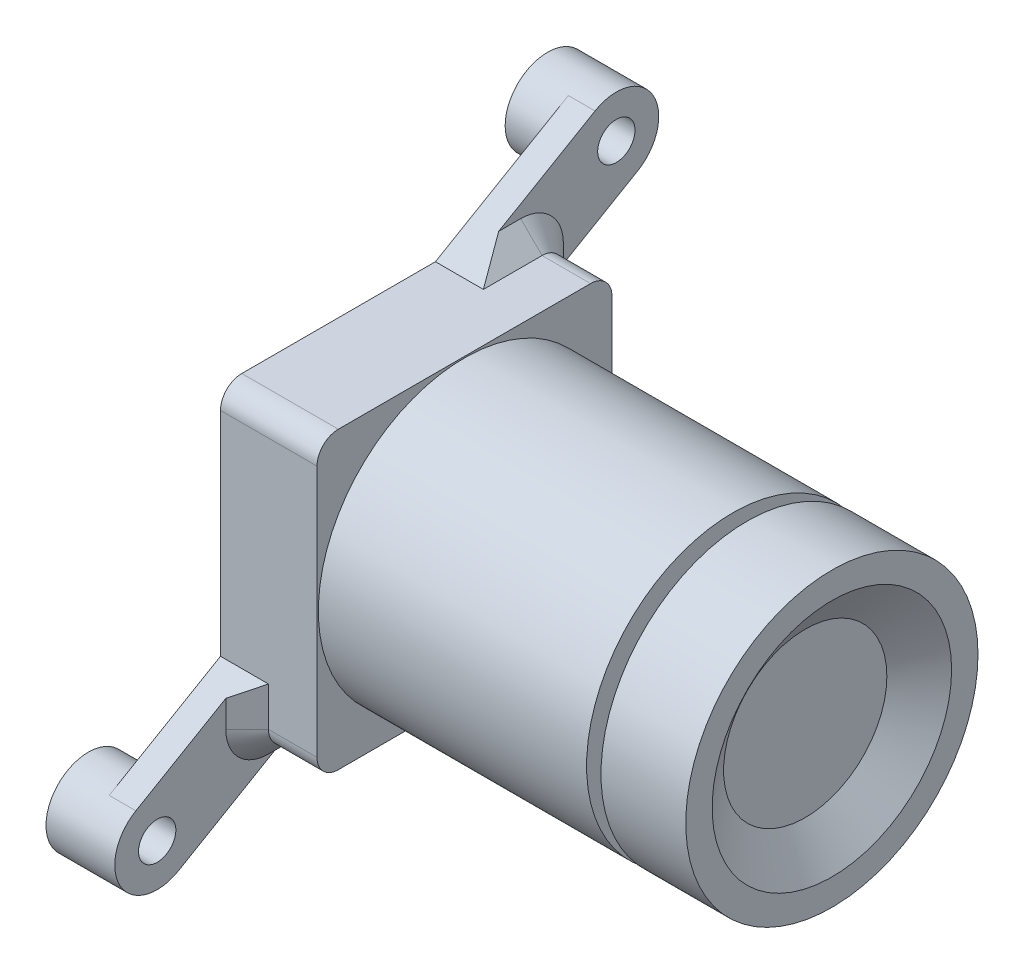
from build123d import *

# Parameters (mm, degrees)
SKETCH1_W          = 14.0462
SKETCH1_H          = 14.0462
EXTRUDE1_DEPTH     = 4.5974
SKETCH2_R          = 6.9596
EXTRUDE2_DEPTH     = 12.7762
SKETCH3_R          = 5.5626
EXTRUDE3_DEPTH     = 0.6858
SKETCH4_R          = 6.9596
EXTRUDE4_DEPTH     = 4.0386
SKETCH5_R          = 5.7023
CUT_EXTRUDE1_DEPTH = 1.27
CUT_EXTRUDE1_DRAFT = -55
EXTRUDE5_DEPTH     = 1.27
FILLET1_R          = 1.016
CHAMFER1_SIZE      = 1.016
FILLET4_RADIUS     = 2.0193
FILLET4_LENGTH     = 1.27
FILLET5_RADIUS     = 2.0193
FILLET5_LENGTH     = 1.27
EXTRUDE6_START     = 2.0066
SKETCH7_R          = 2.0193
EXTRUDE6_DEPTH     = 2.0066
SKETCH8_R          = 0.889
CUT_EXTRUDE2_DEPTH = 30.653419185


with BuildPart() as part:
    # Sketch1 → Extrude1 (new body)
    with BuildSketch(Plane(origin=(0, 0, 0), x_dir=(0, 0, -1), z_dir=(1, 0, 0))):
        Rectangle(SKETCH1_W, SKETCH1_H)
    extrude(amount=-EXTRUDE1_DEPTH)

    # Sketch2 → Extrude2 (add)
    with BuildSketch(Plane(origin=(0, 0, 0), x_dir=(0, 0, -1), z_dir=(1, 0, 0))):
        Circle(SKETCH2_R)
    extrude(amount=EXTRUDE2_DEPTH)

    # Sketch3 → Extrude3 (add)
    with BuildSketch(Plane(origin=(12.7762, 0, 0), x_dir=(0, 0, -1), z_dir=(1, 0, 0))):
        Circle(SKETCH3_R)
    extrude(amount=EXTRUDE3_DEPTH)

    # Sketch4 → Extrude4 (add)
    with BuildSketch(Plane(origin=(13.462, 0, 0), x_dir=(0, 0, -1), z_dir=(1, 0, 0))):
        Circle(SKETCH4_R)
    extrude(amount=EXTRUDE4_DEPTH)


with BuildPart() as cut_extrude1_tool:
    # Sketch5 → Cut-Extrude1 (with draft: the straight prism first)
    with BuildSketch(Plane(origin=(17.5006, 0, 0), x_dir=(0, 0, -1), z_dir=(1, 0, 0))):
        Circle(SKETCH5_R)
    extrude(amount=-CUT_EXTRUDE1_DEPTH)
    # Cut-Extrude1: the draft: its side faces are tilted about the plane it starts from
    cut_extrude1_sides = [cut_extrude1_tool.faces().sort_by_distance(p)[0] for p in [
        (16.8656, 0, 5.7023),
    ]]
    draft(cut_extrude1_sides, Plane(origin=(17.5006, 0, 0), x_dir=(0, 0, -1), z_dir=(1, 0, 0)), CUT_EXTRUDE1_DRAFT)


with BuildPart() as part_1:
    add(part.part)

    # Cut-Extrude1: cut by cut_extrude1_tool
    add(cut_extrude1_tool.part, mode=Mode.SUBTRACT)

    # Sketch6 → Extrude5 (add)
    with BuildSketch(Plane.ZY.offset(4.5974)):
        Polygon((-7.0231, 4.568482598), (-13.322774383, 8.237563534), (-11.29020932, 11.727401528), (-3.2131, 7.0231), (-7.0231, 7.0231), align=None)
        Polygon((3.959354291, -7.0231), (12.036463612, -11.727401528), (14.069028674, -8.237563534), (7.0231, -4.133846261), (7.0231, -7.0231), align=None)
    extrude(amount=-EXTRUDE5_DEPTH)

    # Fillet1
    fillet1_edges = [part_1.edges().sort_by_distance(p)[0] for p in [
        (-1.6637, 7.0231, -7.0231),
        (-1.6637, -7.0231, 7.0231),
        (-2.2987, 7.0231, 7.0231),
        (-2.2987, -7.0231, -7.0231),
    ]]
    fillet(fillet1_edges, radius=FILLET1_R)

    # Chamfer1
    chamfer1_edges = [part_1.edges().sort_by_distance(p)[0] for p in [
        (-3.3274, 5.287791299, -7.0231),
        (-3.3274, -5.070473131, 7.0231),
        (-3.3274, -7.0231, 4.983227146),
        (-3.3274, 7.0231, -4.6101),
        (-3.3274, 6.72552049, -6.72552049),
        (-3.3274, -6.72552049, 6.72552049),
    ]]
    chamfer(chamfer1_edges, length=CHAMFER1_SIZE)

    # Fillet4: full round fillet: the end face becomes a half cylinder, R = half its width
    fillet4_face = Plane((-3.9624, 9.982482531, -12.306491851), x_dir=(-1, 0, 0), z_dir=(0, 0.503284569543, -0.864120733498))  # on the end face: x along it, z out of the body
    fillet4_slab = fillet4_face.offset(-FILLET4_RADIUS / 2) * Box(FILLET4_LENGTH, 2 * FILLET4_RADIUS, FILLET4_RADIUS, mode=Mode.PRIVATE)  # the body's end, R deep
    fillet4_round = Plane((-3.9624, 8.9662, -10.561572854), x_dir=(0, 0.503284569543, -0.864120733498), z_dir=(-1, 0, 0)) * Cylinder(FILLET4_RADIUS, FILLET4_LENGTH, mode=Mode.PRIVATE)  # its axis R under the face
    add(fillet4_slab - fillet4_round, mode=Mode.SUBTRACT)

    # Fillet5: full round fillet: the end face becomes a half cylinder, R = half its width
    fillet5_face = Plane((-3.9624, -9.982482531, 13.052746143), x_dir=(-1, 0, 0), z_dir=(0, -0.503284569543, 0.864120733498))  # on the end face: x along it, z out of the body
    fillet5_slab = fillet5_face.offset(-FILLET5_RADIUS / 2) * Box(FILLET5_LENGTH, 2 * FILLET5_RADIUS, FILLET5_RADIUS, mode=Mode.PRIVATE)  # the body's end, R deep
    fillet5_round = Plane((-3.9624, -8.9662, 11.307827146), x_dir=(0, -0.503284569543, 0.864120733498), z_dir=(-1, 0, 0)) * Cylinder(FILLET5_RADIUS, FILLET5_LENGTH, mode=Mode.PRIVATE)  # its axis R under the face
    add(fillet5_slab - fillet5_round, mode=Mode.SUBTRACT)

    # Sketch7 → Extrude6 (add)
    with BuildSketch(Plane.ZY.offset(4.5974).offset(EXTRUDE6_START)):
        with Locations((-10.561572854, 8.9662)):
            Circle(SKETCH7_R)
        with Locations((11.307827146, -8.9662)):
            Circle(SKETCH7_R)
    extrude(amount=-EXTRUDE6_DEPTH)

    # Sketch8 → Cut-Extrude2 (cut, through all)
    with BuildSketch(Plane.ZY.offset(6.604)):
        with Locations((-10.561572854, 8.9662)):
            Circle(SKETCH8_R)
        with Locations((11.307827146, -8.9662)):
            Circle(SKETCH8_R)
    extrude(amount=-CUT_EXTRUDE2_DEPTH, mode=Mode.SUBTRACT)


solid = part_1.part
